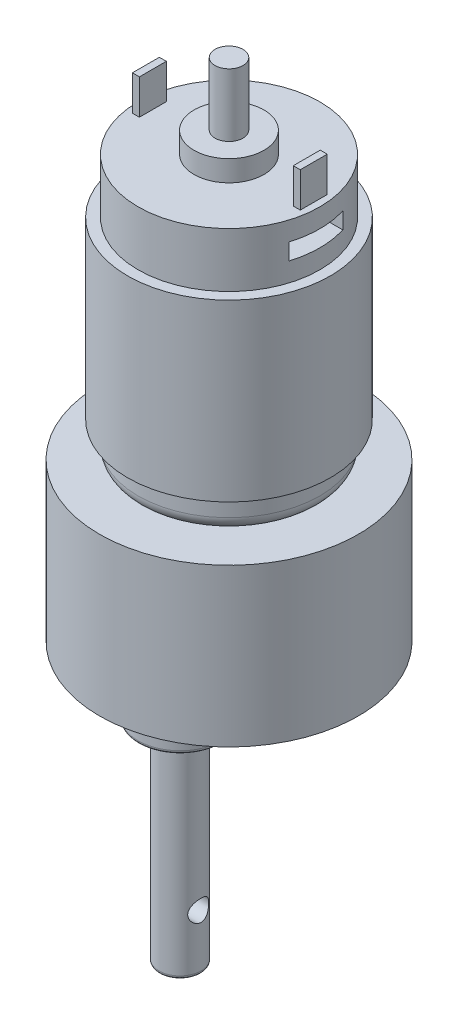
from build123d import *

# Parameters (mm, degrees)
SKETCH1_R                  = 18.5
BOSS_EXTRUDE1_DEPTH        = 22.5
SKETCH2_R                  = 13
BOSS_EXTRUDE2_DEPTH        = 37.8
SKETCH3_R                  = 14.5
BOSS_EXTRUDE3_DEPTH        = 25
FILLET1_R                  = 2
SKETCH4_R                  = 6
BOSS_EXTRUDE4_DEPTH        = 6.3
FILLET2_R                  = 0.5
SKETCH5_R                  = 3
BOSS_EXTRUDE5_DEPTH        = 30
FILLET3_R                  = 0.5
CUT_EXTRUDE1_DEPTH         = 30
CUT_EXTRUDE1_DEPTH_BACK    = 30
SKETCH6_R                  = 1.5
CUT_EXTRUDE2_DEPTH         = 30
CUT_EXTRUDE2_DEPTH_BACK    = 30
SKETCH7_W                  = 7.711651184
SKETCH7_H                  = 2.356337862
SKETCH8_R                  = 5
BOSS_EXTRUDE6_DEPTH        = 3
SKETCH9_R                  = 2
BOSS_EXTRUDE7_DEPTH        = 9
SKETCH10_W                 = 1
SKETCH10_H                 = 3.854338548
BOSS_EXTRUDE8_DEPTH        = 5
BOSS_EXTRUDE8_2_DEPTH      = 5
M3_TAPPED_HOLE1_AT_2_COUNT = 2
M3_TAPPED_HOLE1_AT_2_PITCH = 15.5
M3_TAPPED_HOLE1_AT_3_COUNT = 2
M3_TAPPED_HOLE1_AT_3_PITCH = 26.846787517
M3_TAPPED_HOLE1_AT_4_COUNT = 2
M3_TAPPED_HOLE1_AT_4_PITCH = 31
M3_TAPPED_HOLE1_AT_5_COUNT = 2
M3_TAPPED_HOLE1_AT_5_PITCH = 26.846787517
M3_TAPPED_HOLE1_AT_6_COUNT = 2
M3_TAPPED_HOLE1_AT_6_PITCH = 15.5


with BuildPart() as part:
    # Sketch1 → Boss-Extrude1 (new body)
    with BuildSketch(Plane(origin=(0, 0, 0), x_dir=(1, 0, 0), z_dir=(0, 1, 0))):
        with Locations(Location((0, 0, 0), (0, 0, 90))):
            Circle(SKETCH1_R)
    extrude(amount=BOSS_EXTRUDE1_DEPTH)

    # Sketch4 → Boss-Extrude4 (add)
    with BuildSketch(Plane.XZ):
        with Locations(Location((0, 7, 0), (0, 0, 90))):
            Circle(SKETCH4_R)
    extrude(amount=BOSS_EXTRUDE4_DEPTH)

    # Fillet2
    fillet2_edges = [part.edges().sort_by_distance(p)[0] for p in [
        (0, -6.3, 1),
    ]]
    fillet(fillet2_edges, radius=FILLET2_R)

    # Sketch12 → M3 Tapped Hole1 (revolve, cut)
    with BuildSketch(Plane(origin=(-15.5, 0, 0), x_dir=(0, 0, -1), z_dir=(1, 0, 0))):
        Polygon((0, 0), (0, 4.251075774), (1.25, 3.5), (1.25, 0), align=None)
    m3_tapped_hole1 = revolve(axis=Axis((-15.5, -6.35, 0), (0, 1, 0)), mode=Mode.SUBTRACT)

    # M3 Tapped Hole1 at 2: M3 Tapped Hole1 ×2
    with Locations(*[Vector(0.5000000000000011, 0, 0.866025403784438) * (i * M3_TAPPED_HOLE1_AT_2_PITCH) for i in range(1, M3_TAPPED_HOLE1_AT_2_COUNT)]):
        add(m3_tapped_hole1, mode=Mode.SUBTRACT)

    # M3 Tapped Hole1 at 3: M3 Tapped Hole1 ×2
    with Locations(*[Vector(0.8660254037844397, 0, 0.4999999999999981) * (i * M3_TAPPED_HOLE1_AT_3_PITCH) for i in range(1, M3_TAPPED_HOLE1_AT_3_COUNT)]):
        add(m3_tapped_hole1, mode=Mode.SUBTRACT)

    # M3 Tapped Hole1 at 4: M3 Tapped Hole1 ×2
    with Locations(*[(i * M3_TAPPED_HOLE1_AT_4_PITCH, 0, 0) for i in range(1, M3_TAPPED_HOLE1_AT_4_COUNT)]):
        add(m3_tapped_hole1, mode=Mode.SUBTRACT)

    # M3 Tapped Hole1 at 5: M3 Tapped Hole1 ×2
    with Locations(*[Vector(0.8660254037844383, 0, -0.5000000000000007) * (i * M3_TAPPED_HOLE1_AT_5_PITCH) for i in range(1, M3_TAPPED_HOLE1_AT_5_COUNT)]):
        add(m3_tapped_hole1, mode=Mode.SUBTRACT)

    # M3 Tapped Hole1 at 6: M3 Tapped Hole1 ×2
    with Locations(*[Vector(0.49999999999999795, 0, -0.8660254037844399) * (i * M3_TAPPED_HOLE1_AT_6_PITCH) for i in range(1, M3_TAPPED_HOLE1_AT_6_COUNT)]):
        add(m3_tapped_hole1, mode=Mode.SUBTRACT)


with BuildPart() as body_2:
    # Sketch2 → Boss-Extrude2 (new body)
    with BuildSketch(Plane(origin=(0, 22.5, 0), x_dir=(1, 0, 0), z_dir=(0, 1, 0))):
        with Locations(Location((0, 0, 0), (0, 0, 270))):
            Circle(SKETCH2_R)
    extrude(amount=BOSS_EXTRUDE2_DEPTH)

    # Sketch3 → Boss-Extrude3 (add)
    with BuildSketch(Plane(origin=(0, 27.5, 0), x_dir=(1, 0, 0), z_dir=(0, 1, 0))):
        with Locations(Location((0, 0, 0), (0, 0, 270))):
            Circle(SKETCH3_R)
    extrude(amount=BOSS_EXTRUDE3_DEPTH)

    # Fillet1
    fillet1_edges = [body_2.edges().sort_by_distance(p)[0] for p in [
        (0, 22.5, -13),
    ]]
    fillet(fillet1_edges, radius=FILLET1_R)

    # Sketch7 → Cut-Extrude2 (cut, two sides: drawn at the far end of the back side and taken through both)
    with BuildSketch(Plane(origin=(0, 0, 0), x_dir=(0, 0, -1), z_dir=(1, 0, 0)).offset(-CUT_EXTRUDE2_DEPTH_BACK)):
        with Locations((0, 56.4)):
            Rectangle(SKETCH7_W, SKETCH7_H)
    extrude(amount=CUT_EXTRUDE2_DEPTH + CUT_EXTRUDE2_DEPTH_BACK, mode=Mode.SUBTRACT)

    # Sketch8 → Boss-Extrude6 (add)
    with BuildSketch(Plane(origin=(0, 60.3, 0), x_dir=(1, 0, 0), z_dir=(0, 1, 0))):
        with Locations(Location((0, 0, 0), (0, 0, 270))):
            Circle(SKETCH8_R)
    extrude(amount=BOSS_EXTRUDE6_DEPTH)

    # Sketch9 → Boss-Extrude7 (add)
    with BuildSketch(Plane(origin=(0, 63.3, 0), x_dir=(1, 0, 0), z_dir=(0, 1, 0))):
        with Locations(Location((0, 0, 0), (0, 0, 270))):
            Circle(SKETCH9_R)
    extrude(amount=BOSS_EXTRUDE7_DEPTH)


with BuildPart() as body_3:
    # Sketch5 → Boss-Extrude5 (new body)
    with BuildSketch(Plane.XZ.offset(6.3)):
        with Locations(Location((0, 7, 0), (0, 0, 270))):
            Circle(SKETCH5_R)
    extrude(amount=BOSS_EXTRUDE5_DEPTH)

    # Fillet3
    fillet3_edges = [body_3.edges().sort_by_distance(p)[0] for p in [
        (0, -36.3, 10),
    ]]
    fillet(fillet3_edges, radius=FILLET3_R)

    # Sketch6 → Cut-Extrude1 (cut, two sides: drawn at the far end of the back side and taken through both)
    with BuildSketch(Plane(origin=(0, 0, 0), x_dir=(0, 0, -1), z_dir=(1, 0, 0)).offset(-CUT_EXTRUDE1_DEPTH_BACK)):
        with Locations(Location((-7, -28.3, 0), (0, 0, 180))):
            Circle(SKETCH6_R)
    extrude(amount=CUT_EXTRUDE1_DEPTH + CUT_EXTRUDE1_DEPTH_BACK, mode=Mode.SUBTRACT)


with BuildPart() as body_4:
    # Sketch10 → Boss-Extrude8 (new body)
    with BuildSketch(Plane(origin=(0, 60.3, 0), x_dir=(1, 0, 0), z_dir=(0, 1, 0))):
        with Locations((11.5, 0.116798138)):
            Rectangle(SKETCH10_W, SKETCH10_H)
    extrude(amount=BOSS_EXTRUDE8_DEPTH)


with BuildPart() as body_5:
    # Sketch10 → Boss-Extrude8 2 (new body)
    with BuildSketch(Plane(origin=(0, 60.3, 0), x_dir=(1, 0, 0), z_dir=(0, 1, 0))):
        with Locations((-11.5, 0.116798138)):
            Rectangle(SKETCH10_W, SKETCH10_H)
    extrude(amount=BOSS_EXTRUDE8_2_DEPTH)


solid = Compound([part.part, body_2.part, body_3.part, body_4.part, body_5.part])
